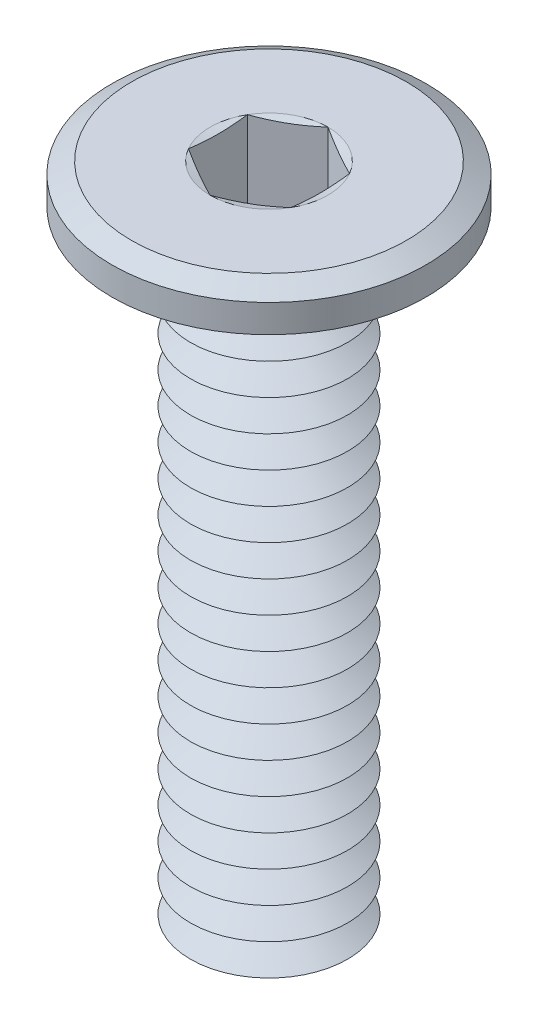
from build123d import *

# Parameters (mm, degrees)
SKETCH1_R           = 2
BOSS_EXTRUDE1_DEPTH = 0.5
SKETCH2_R           = 1
BOSS_EXTRUDE2_DEPTH = 8
LPATTERN1_COUNT     = 19
LPATTERN1_PITCH     = 0.4
FILLET1_R           = 0.1
CHAMFER2_SIZE       = 0.25
CHAMFER2_SIZE2      = 0.144337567
CUT_EXTRUDE1_DEPTH  = 1.2


with BuildPart() as part:
    # Sketch1 → Boss-Extrude1 (new body)
    with BuildSketch(Plane(origin=(0, 0, 0), x_dir=(1, 0, 0), z_dir=(0, 1, 0))):
        with Locations(Location((0, 0, 0), (0, 0, 270))):
            Circle(SKETCH1_R)
    extrude(amount=-BOSS_EXTRUDE1_DEPTH)

    # Sketch2 → Boss-Extrude2 (add)
    with BuildSketch(Plane.XZ.offset(0.5)):
        with Locations(Location((0, 0, 0), (0, 0, 270))):
            Circle(SKETCH2_R)
    extrude(amount=BOSS_EXTRUDE2_DEPTH)

    # Sketch5 → Cut-Revolve1 (revolve, cut)
    with BuildSketch(Plane(origin=(0, 0, 0), x_dir=(0, 0, -1), z_dir=(1, 0, 0))):
        Polygon((-1, -8.7), (-0.653589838, -8.5), (-1, -8.3), align=None)
    cut_revolve1 = revolve(axis=Axis((0, 0.990593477, 0), (0, -1, 0)), mode=Mode.SUBTRACT)

    # LPattern1: Cut-Revolve1 ×19
    with Locations(*[(0, i * LPATTERN1_PITCH, 0) for i in range(1, LPATTERN1_COUNT)]):
        add(cut_revolve1, mode=Mode.SUBTRACT)

    # Fillet1
    fillet1_edges = [part.edges().sort_by_distance(p)[0] for p in [
        (0, -0.5, 1),
    ]]
    fillet(fillet1_edges, radius=FILLET1_R)

    # Chamfer2
    chamfer2_edges = [part.edges().sort_by_distance(p)[0] for p in [
        (0, 0, -2),
    ]]
    chamfer2_side = [part.faces().sort_by_distance(p)[0] for p in [
        (0, 0, 0),
    ]]
    chamfer(chamfer2_edges, length=CHAMFER2_SIZE, length2=CHAMFER2_SIZE2, reference=chamfer2_side[0])

    # Sketch6 → Cut-Extrude1 (cut)
    with BuildSketch(Plane(origin=(0, 0, 0), x_dir=(1, 0, 0), z_dir=(0, 1, 0))):
        Polygon((0, 0.75055535), (-0.65, 0.375277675), (-0.65, -0.375277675), (0, -0.75055535), (0.65, -0.375277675), (0.65, 0.375277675), align=None)
    extrude(amount=-CUT_EXTRUDE1_DEPTH, mode=Mode.SUBTRACT)

    # Cut-Extrude2 cone 1 section (on through the dimple's axis) → Cut-Extrude2 (revolve, cut)
    with BuildSketch(Plane(origin=(0, -1.2, 0), x_dir=(0, 0, 1), z_dir=(1, 0, 0))):
        Polygon((0, 0), (0.65, 0), (0, 0.375277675), align=None)
    revolve(axis=Axis((0, -1.2, 0), (0, -1, 0)), mode=Mode.SUBTRACT)

    # Cut-Extrude3 cone 1 section (on through the dimple's axis) → Cut-Extrude3 (revolve, cut)
    with BuildSketch(Plane(origin=(0, 0, 0), x_dir=(0, 0, 1), z_dir=(1, 0, 0))):
        Polygon((0, 0), (0.75055535, 0), (0, 0.2011107), align=None)
    revolve(axis=Axis((0, 0, 0), (0, -1, 0)), mode=Mode.SUBTRACT)


solid = part.part
